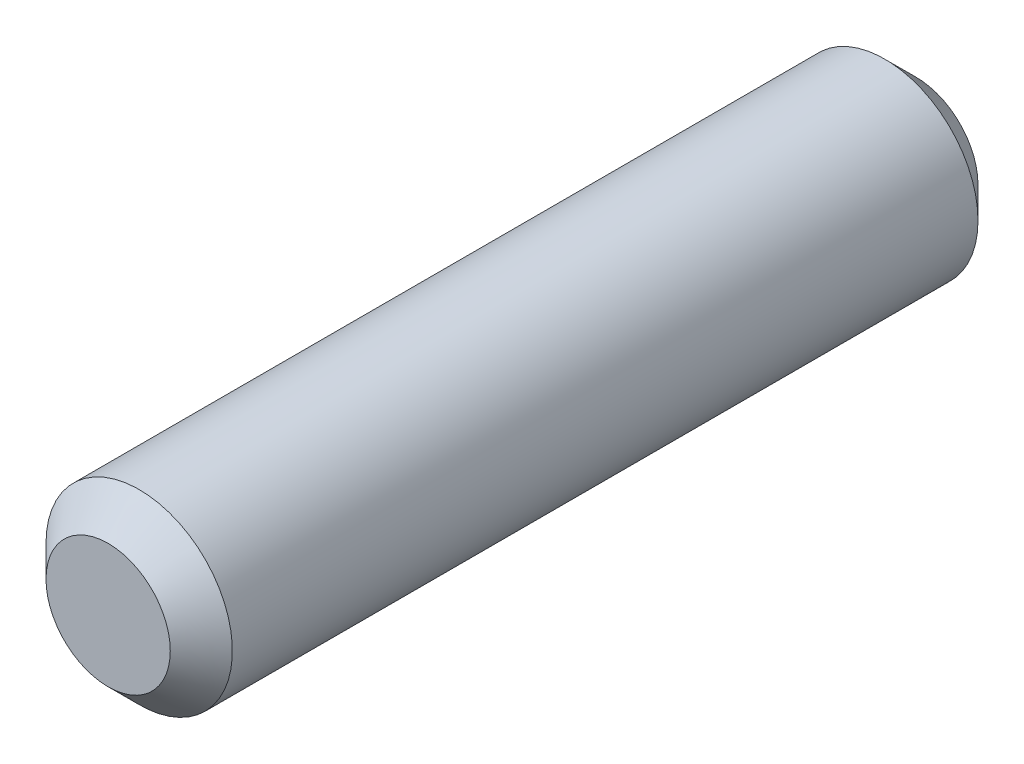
ISO-10303-21;
HEADER;
FILE_DESCRIPTION(('STEP AP214'),'2;1');
FILE_NAME('part.step','',(''),(''),'','','');
FILE_SCHEMA(('AUTOMOTIVE_DESIGN { 1 0 10303 214 1 1 1 1 }'));
ENDSEC;
DATA;
#1=APPLICATION_CONTEXT('core data for automotive mechanical design processes');
#2=APPLICATION_PROTOCOL_DEFINITION('international standard','automotive_design',2000,#1);
#3=PRODUCT_CONTEXT('',#1,'mechanical');
#4=PRODUCT('Part','Part','',(#3));
#5=PRODUCT_RELATED_PRODUCT_CATEGORY('part','',(#4));
#6=PRODUCT_DEFINITION_FORMATION('','',#4);
#7=PRODUCT_DEFINITION_CONTEXT('part definition',#1,'design');
#8=PRODUCT_DEFINITION('design','',#6,#7);
#9=PRODUCT_DEFINITION_SHAPE('','',#8);
#10=(LENGTH_UNIT() NAMED_UNIT(*) SI_UNIT(.MILLI.,.METRE.));
#11=(NAMED_UNIT(*) PLANE_ANGLE_UNIT() SI_UNIT($,.RADIAN.));
#12=(NAMED_UNIT(*) SI_UNIT($,.STERADIAN.) SOLID_ANGLE_UNIT());
#13=UNCERTAINTY_MEASURE_WITH_UNIT(LENGTH_MEASURE(1.E-05),#10,'distance_accuracy_value','');
#14=(GEOMETRIC_REPRESENTATION_CONTEXT(3) GLOBAL_UNCERTAINTY_ASSIGNED_CONTEXT((#13)) GLOBAL_UNIT_ASSIGNED_CONTEXT((#10,
#11,#12)) REPRESENTATION_CONTEXT('',''));
#15=CARTESIAN_POINT('',(0.,0.,0.));
#16=DIRECTION('',(0.,0.,1.));
#17=DIRECTION('',(1.,0.,0.));
#18=AXIS2_PLACEMENT_3D('',#15,#16,#17);
#19=CARTESIAN_POINT('',(0.,0.,6.50000000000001));
#20=DIRECTION('',(0.,0.,-1.));
#21=DIRECTION('',(-1.,0.,0.));
#22=AXIS2_PLACEMENT_3D('',#19,#20,#21);
#23=CYLINDRICAL_SURFACE('',#22,1.5);
#24=CARTESIAN_POINT('',(0.,0.,-5.99999999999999));
#25=DIRECTION('',(0.,0.,1.));
#26=DIRECTION('',(1.,0.,0.));
#27=AXIS2_PLACEMENT_3D('',#24,#25,#26);
#28=CIRCLE('',#27,1.5);
#29=CARTESIAN_POINT('',(-1.5,0.,-5.99999999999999));
#30=VERTEX_POINT('',#29);
#31=EDGE_CURVE('E39',#30,#30,#28,.T.);
#32=CARTESIAN_POINT('',(0.,0.,5.99999999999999));
#33=DIRECTION('',(0.,0.,1.));
#34=DIRECTION('',(1.,0.,0.));
#35=AXIS2_PLACEMENT_3D('',#32,#33,#34);
#36=CIRCLE('',#35,1.5);
#37=CARTESIAN_POINT('',(-1.5,0.,5.99999999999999));
#38=VERTEX_POINT('',#37);
#39=EDGE_CURVE('E43',#38,#38,#36,.F.);
#40=CARTESIAN_POINT('',(-1.5,0.,-5.99999999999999));
#41=CARTESIAN_POINT('',(-1.5,0.,-5.87499999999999));
#42=CARTESIAN_POINT('',(-1.5,0.,-5.74999999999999));
#43=CARTESIAN_POINT('',(-1.5,0.,-5.49999999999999));
#44=CARTESIAN_POINT('',(-1.5,0.,-5.37499999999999));
#45=CARTESIAN_POINT('',(-1.5,0.,-5.12499999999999));
#46=CARTESIAN_POINT('',(-1.5,0.,-4.99999999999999));
#47=CARTESIAN_POINT('',(-1.5,0.,-4.74999999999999));
#48=CARTESIAN_POINT('',(-1.5,0.,-4.62499999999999));
#49=CARTESIAN_POINT('',(-1.5,0.,-4.375));
#50=CARTESIAN_POINT('',(-1.5,0.,-4.24999999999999));
#51=CARTESIAN_POINT('',(-1.5,0.,-3.99999999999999));
#52=CARTESIAN_POINT('',(-1.5,0.,-3.87499999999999));
#53=CARTESIAN_POINT('',(-1.5,0.,-3.625));
#54=CARTESIAN_POINT('',(-1.5,0.,-3.5));
#55=CARTESIAN_POINT('',(-1.5,0.,-3.25));
#56=CARTESIAN_POINT('',(-1.5,0.,-3.125));
#57=CARTESIAN_POINT('',(-1.5,0.,-2.875));
#58=CARTESIAN_POINT('',(-1.5,0.,-2.75));
#59=CARTESIAN_POINT('',(-1.5,0.,-2.5));
#60=CARTESIAN_POINT('',(-1.5,0.,-2.375));
#61=CARTESIAN_POINT('',(-1.5,0.,-2.125));
#62=CARTESIAN_POINT('',(-1.5,0.,-2.));
#63=CARTESIAN_POINT('',(-1.5,0.,-1.75));
#64=CARTESIAN_POINT('',(-1.5,0.,-1.625));
#65=CARTESIAN_POINT('',(-1.5,0.,-1.375));
#66=CARTESIAN_POINT('',(-1.5,0.,-1.25));
#67=CARTESIAN_POINT('',(-1.5,0.,-0.999999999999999));
#68=CARTESIAN_POINT('',(-1.5,0.,-0.875));
#69=CARTESIAN_POINT('',(-1.5,0.,-0.625));
#70=CARTESIAN_POINT('',(-1.5,0.,-0.5));
#71=CARTESIAN_POINT('',(-1.5,0.,-0.250000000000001));
#72=CARTESIAN_POINT('',(-1.5,0.,-0.125000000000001));
#73=CARTESIAN_POINT('',(-1.5,0.,0.124999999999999));
#74=CARTESIAN_POINT('',(-1.5,0.,0.249999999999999));
#75=CARTESIAN_POINT('',(-1.5,0.,0.499999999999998));
#76=CARTESIAN_POINT('',(-1.5,0.,0.624999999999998));
#77=CARTESIAN_POINT('',(-1.5,0.,0.874999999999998));
#78=CARTESIAN_POINT('',(-1.5,0.,0.999999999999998));
#79=CARTESIAN_POINT('',(-1.5,0.,1.25));
#80=CARTESIAN_POINT('',(-1.5,0.,1.375));
#81=CARTESIAN_POINT('',(-1.5,0.,1.625));
#82=CARTESIAN_POINT('',(-1.5,0.,1.75));
#83=CARTESIAN_POINT('',(-1.5,0.,2.));
#84=CARTESIAN_POINT('',(-1.5,0.,2.125));
#85=CARTESIAN_POINT('',(-1.5,0.,2.375));
#86=CARTESIAN_POINT('',(-1.5,0.,2.5));
#87=CARTESIAN_POINT('',(-1.5,0.,2.75));
#88=CARTESIAN_POINT('',(-1.5,0.,2.875));
#89=CARTESIAN_POINT('',(-1.5,0.,3.125));
#90=CARTESIAN_POINT('',(-1.5,0.,3.25));
#91=CARTESIAN_POINT('',(-1.5,0.,3.49999999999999));
#92=CARTESIAN_POINT('',(-1.5,0.,3.625));
#93=CARTESIAN_POINT('',(-1.5,0.,3.87499999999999));
#94=CARTESIAN_POINT('',(-1.5,0.,3.99999999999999));
#95=CARTESIAN_POINT('',(-1.5,0.,4.24999999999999));
#96=CARTESIAN_POINT('',(-1.5,0.,4.37499999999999));
#97=CARTESIAN_POINT('',(-1.5,0.,4.62499999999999));
#98=CARTESIAN_POINT('',(-1.5,0.,4.74999999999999));
#99=CARTESIAN_POINT('',(-1.5,0.,4.99999999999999));
#100=CARTESIAN_POINT('',(-1.5,0.,5.12499999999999));
#101=CARTESIAN_POINT('',(-1.5,0.,5.37499999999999));
#102=CARTESIAN_POINT('',(-1.5,0.,5.49999999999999));
#103=CARTESIAN_POINT('',(-1.5,0.,5.74999999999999));
#104=CARTESIAN_POINT('',(-1.5,0.,5.87499999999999));
#105=CARTESIAN_POINT('',(-1.5,0.,5.99999999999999));
#106=B_SPLINE_CURVE_WITH_KNOTS('',3,(#40,#41,#42,#43,#44,#45,#46,#47,#48,#49,#50,#51,#52,#53,
#54,#55,#56,#57,#58,#59,#60,#61,#62,#63,#64,#65,#66,#67,#68,#69,#70,#71,#72,#73,#74,#75,#76,#77,
#78,#79,#80,#81,#82,#83,#84,#85,#86,#87,#88,#89,#90,#91,#92,#93,#94,#95,#96,#97,#98,#99,#100,
#101,#102,#103,#104,#105),.UNSPECIFIED.,.F.,.F.,(4,2,2,2,2,2,2,2,2,2,2,2,2,2,2,2,2,2,2,2,2,2,2,
2,2,2,2,2,2,2,2,2,4),(0.,0.375,0.749999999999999,1.125,1.5,1.875,2.25,2.625,3.,3.375,3.75,
4.12499999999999,4.5,4.87499999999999,5.24999999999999,5.62499999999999,5.99999999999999,
6.37499999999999,6.74999999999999,7.12499999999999,7.49999999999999,7.87499999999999,
8.24999999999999,8.62499999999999,8.99999999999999,9.37499999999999,9.74999999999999,10.125,
10.5,10.875,11.25,11.625,12.),.UNSPECIFIED.);
#107=EDGE_CURVE('BSEAM29',#30,#38,#106,.T.);
#108=ORIENTED_EDGE('',*,*,#31,.T.);
#109=ORIENTED_EDGE('',*,*,#39,.T.);
#110=ORIENTED_EDGE('',*,*,#107,.T.);
#111=ORIENTED_EDGE('',*,*,#107,.F.);
#112=EDGE_LOOP('',(#108,#110,#109,#111));
#113=FACE_BOUND('',#112,.T.);
#114=ADVANCED_FACE('F29',(#113),#23,.T.);
#115=CARTESIAN_POINT('',(0.,0.,6.50000000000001));
#116=DIRECTION('',(0.,0.,1.));
#117=DIRECTION('',(1.,0.,0.));
#118=AXIS2_PLACEMENT_3D('',#115,#116,#117);
#119=PLANE('',#118);
#120=CARTESIAN_POINT('',(0.,0.,6.50000000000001));
#121=DIRECTION('',(0.,0.,1.));
#122=DIRECTION('',(1.,0.,0.));
#123=AXIS2_PLACEMENT_3D('',#120,#121,#122);
#124=CIRCLE('',#123,1.);
#125=CARTESIAN_POINT('',(1.,0.,6.50000000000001));
#126=VERTEX_POINT('',#125);
#127=EDGE_CURVE('E10',#126,#126,#124,.T.);
#128=ORIENTED_EDGE('',*,*,#127,.T.);
#129=EDGE_LOOP('',(#128));
#130=FACE_BOUND('',#129,.T.);
#131=ADVANCED_FACE('F62',(#130),#119,.T.);
#132=CARTESIAN_POINT('',(0.,0.,-6.50000000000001));
#133=DIRECTION('',(0.,0.,1.));
#134=DIRECTION('',(1.,0.,0.));
#135=AXIS2_PLACEMENT_3D('',#132,#133,#134);
#136=PLANE('',#135);
#137=CARTESIAN_POINT('',(0.,0.,-6.50000000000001));
#138=DIRECTION('',(0.,0.,1.));
#139=DIRECTION('',(1.,0.,0.));
#140=AXIS2_PLACEMENT_3D('',#137,#138,#139);
#141=CIRCLE('',#140,0.999999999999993);
#142=CARTESIAN_POINT('',(0.999999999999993,0.,-6.50000000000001));
#143=VERTEX_POINT('',#142);
#144=EDGE_CURVE('E35',#143,#143,#141,.F.);
#145=ORIENTED_EDGE('',*,*,#144,.T.);
#146=EDGE_LOOP('',(#145));
#147=FACE_BOUND('',#146,.T.);
#148=ADVANCED_FACE('F58',(#147),#136,.F.);
#149=CARTESIAN_POINT('',(0.,0.,-5.99999999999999));
#150=DIRECTION('',(0.,0.,1.));
#151=DIRECTION('',(1.,0.,0.));
#152=AXIS2_PLACEMENT_3D('',#149,#150,#151);
#153=CONICAL_SURFACE('',#152,1.5,0.785398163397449);
#154=ORIENTED_EDGE('',*,*,#144,.F.);
#155=EDGE_LOOP('',(#154));
#156=FACE_BOUND('',#155,.T.);
#157=ORIENTED_EDGE('',*,*,#31,.F.);
#158=EDGE_LOOP('',(#157));
#159=FACE_BOUND('',#158,.T.);
#160=ADVANCED_FACE('F53',(#156,#159),#153,.T.);
#161=CARTESIAN_POINT('',(0.,0.,6.50000000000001));
#162=DIRECTION('',(0.,0.,-1.));
#163=DIRECTION('',(-1.,0.,0.));
#164=AXIS2_PLACEMENT_3D('',#161,#162,#163);
#165=CONICAL_SURFACE('',#164,1.,0.785398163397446);
#166=ORIENTED_EDGE('',*,*,#39,.F.);
#167=EDGE_LOOP('',(#166));
#168=FACE_BOUND('',#167,.T.);
#169=ORIENTED_EDGE('',*,*,#127,.F.);
#170=EDGE_LOOP('',(#169));
#171=FACE_BOUND('',#170,.T.);
#172=ADVANCED_FACE('F50',(#168,#171),#165,.T.);
#173=CLOSED_SHELL('',(#114,#131,#148,#160,#172));
#174=MANIFOLD_SOLID_BREP('B2',#173);
#175=ADVANCED_BREP_SHAPE_REPRESENTATION('',(#18,#174),#14);
#176=SHAPE_DEFINITION_REPRESENTATION(#9,#175);
ENDSEC;
END-ISO-10303-21;
